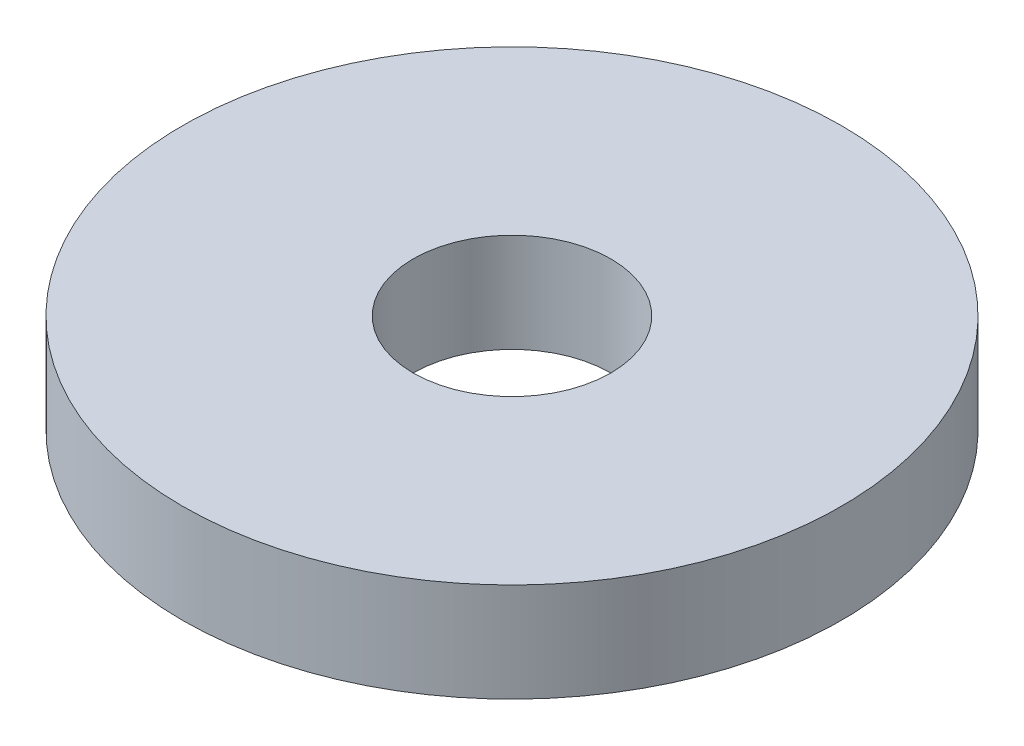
from build123d import *

# Parameters (mm, degrees)
FLANGESKETCH_R      = 50
FLANGEBOSS_DEPTH    = 15
CENTERHOLESKETCH_R  = 15
CENTERHOLECUT_DEPTH = 15


with BuildPart() as part:
    # FlangeSketch → FlangeBoss (new body)
    with BuildSketch(Plane(origin=(0, 0, 0), x_dir=(1, 0, 0), z_dir=(0, 1, 0))):
        with Locations(Location((0, 0, 0), (0, 0, 270))):
            Circle(FLANGESKETCH_R)
    extrude(amount=-FLANGEBOSS_DEPTH)

    # CenterHoleSketch → CenterHoleCut (cut)
    with BuildSketch(Plane(origin=(0, 0, 0), x_dir=(1, 0, 0), z_dir=(0, 1, 0))):
        with Locations(Location((0, 0, 0), (0, 0, 270))):
            Circle(CENTERHOLESKETCH_R)
    extrude(amount=-CENTERHOLECUT_DEPTH, mode=Mode.SUBTRACT)


solid = part.part
